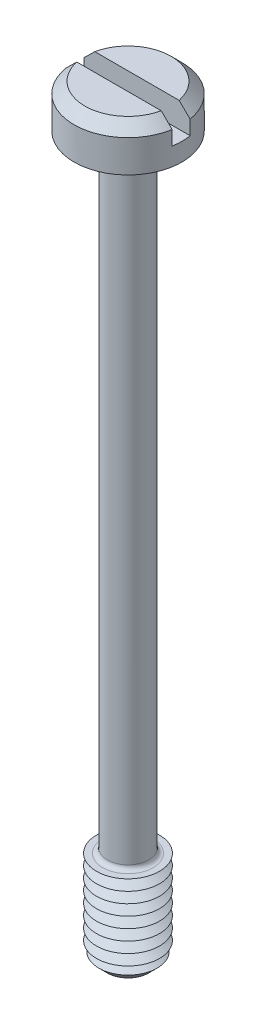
ISO-10303-21;
HEADER;
FILE_DESCRIPTION(('STEP AP214'),'2;1');
FILE_NAME('part.step','',(''),(''),'','','');
FILE_SCHEMA(('AUTOMOTIVE_DESIGN { 1 0 10303 214 1 1 1 1 }'));
ENDSEC;
DATA;
#1=APPLICATION_CONTEXT('core data for automotive mechanical design processes');
#2=APPLICATION_PROTOCOL_DEFINITION('international standard','automotive_design',2000,#1);
#3=PRODUCT_CONTEXT('',#1,'mechanical');
#4=PRODUCT('Part','Part','',(#3));
#5=PRODUCT_RELATED_PRODUCT_CATEGORY('part','',(#4));
#6=PRODUCT_DEFINITION_FORMATION('','',#4);
#7=PRODUCT_DEFINITION_CONTEXT('part definition',#1,'design');
#8=PRODUCT_DEFINITION('design','',#6,#7);
#9=PRODUCT_DEFINITION_SHAPE('','',#8);
#10=(LENGTH_UNIT() NAMED_UNIT(*) SI_UNIT(.MILLI.,.METRE.));
#11=(NAMED_UNIT(*) PLANE_ANGLE_UNIT() SI_UNIT($,.RADIAN.));
#12=(NAMED_UNIT(*) SI_UNIT($,.STERADIAN.) SOLID_ANGLE_UNIT());
#13=UNCERTAINTY_MEASURE_WITH_UNIT(LENGTH_MEASURE(1.E-05),#10,'distance_accuracy_value','');
#14=(GEOMETRIC_REPRESENTATION_CONTEXT(3) GLOBAL_UNCERTAINTY_ASSIGNED_CONTEXT((#13)) GLOBAL_UNIT_ASSIGNED_CONTEXT((#10,
#11,#12)) REPRESENTATION_CONTEXT('',''));
#15=CARTESIAN_POINT('',(0.,0.,0.));
#16=DIRECTION('',(0.,0.,1.));
#17=DIRECTION('',(1.,0.,0.));
#18=AXIS2_PLACEMENT_3D('',#15,#16,#17);
#19=CARTESIAN_POINT('',(0.,2.4,0.));
#20=DIRECTION('',(0.,1.,0.));
#21=DIRECTION('',(0.,0.,1.));
#22=AXIS2_PLACEMENT_3D('',#19,#20,#21);
#23=PLANE('',#22);
#24=DIRECTION('',(-1.,0.,0.));
#25=VECTOR('',#24,1.);
#26=CARTESIAN_POINT('',(3.,2.4,-0.5));
#27=LINE('',#26,#25);
#28=CARTESIAN_POINT('',(2.34733891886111,2.4,-0.5));
#29=VERTEX_POINT('',#28);
#30=CARTESIAN_POINT('',(-2.34733891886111,2.4,-0.5));
#31=VERTEX_POINT('',#30);
#32=EDGE_CURVE('E110',#29,#31,#27,.T.);
#33=ORIENTED_EDGE('',*,*,#32,.F.);
#34=CARTESIAN_POINT('',(0.,2.4,0.));
#35=DIRECTION('',(0.,1.,0.));
#36=DIRECTION('',(0.,0.,1.));
#37=AXIS2_PLACEMENT_3D('',#34,#35,#36);
#38=CIRCLE('',#37,2.40000000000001);
#39=EDGE_CURVE('E113',#29,#31,#38,.T.);
#40=ORIENTED_EDGE('',*,*,#39,.T.);
#41=EDGE_LOOP('',(#33,#40));
#42=FACE_BOUND('',#41,.T.);
#43=ADVANCED_FACE('F39',(#42),#23,.T.);
#44=CARTESIAN_POINT('',(0.,2.4,0.));
#45=DIRECTION('',(0.,-1.,0.));
#46=DIRECTION('',(0.,0.,-1.));
#47=AXIS2_PLACEMENT_3D('',#44,#45,#46);
#48=CONICAL_SURFACE('',#47,2.40000000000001,0.785398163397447);
#49=CARTESIAN_POINT('',(6.5992407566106,-1.81815522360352,-0.5));
#50=CARTESIAN_POINT('',(6.36552831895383,-1.58511655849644,-0.5));
#51=CARTESIAN_POINT('',(6.13178603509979,-1.35210779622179,-0.5));
#52=CARTESIAN_POINT('',(5.66419282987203,-0.886182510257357,-0.5));
#53=CARTESIAN_POINT('',(5.43034190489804,-0.653265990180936,-0.5));
#54=CARTESIAN_POINT('',(4.96229492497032,-0.187370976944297,-0.5));
#55=CARTESIAN_POINT('',(4.72809874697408,0.0456073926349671,-0.5));
#56=CARTESIAN_POINT('',(4.25949632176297,0.511336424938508,-0.5));
#57=CARTESIAN_POINT('',(4.0250900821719,0.744087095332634,-0.5));
#58=CARTESIAN_POINT('',(3.56605462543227,1.19918528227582,-0.5));
#59=CARTESIAN_POINT('',(3.34144041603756,1.42154792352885,-0.5));
#60=CARTESIAN_POINT('',(3.00406693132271,1.75465797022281,-0.5));
#61=CARTESIAN_POINT('',(2.89152775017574,1.8656282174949,-0.5));
#62=CARTESIAN_POINT('',(2.66624137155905,2.0873550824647,-0.5));
#63=CARTESIAN_POINT('',(2.55349417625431,2.19811170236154,-0.5));
#64=CARTESIAN_POINT('',(2.32775708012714,2.41925708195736,-0.5));
#65=CARTESIAN_POINT('',(2.21476734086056,2.52964600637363,-0.5));
#66=CARTESIAN_POINT('',(1.98831594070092,2.74994787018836,-0.5));
#67=CARTESIAN_POINT('',(1.87485426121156,2.85986079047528,-0.5));
#68=CARTESIAN_POINT('',(1.64719242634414,3.07888083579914,-0.5));
#69=CARTESIAN_POINT('',(1.53299241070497,3.18798810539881,-0.5));
#70=CARTESIAN_POINT('',(1.36063752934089,3.35052419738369,-0.5));
#71=CARTESIAN_POINT('',(1.30301197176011,3.40451369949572,-0.5));
#72=CARTESIAN_POINT('',(1.18725070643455,3.51194233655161,-0.5));
#73=CARTESIAN_POINT('',(1.12911501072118,3.56538148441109,-0.5));
#74=CARTESIAN_POINT('',(1.03810444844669,3.64783932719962,-0.5));
#75=CARTESIAN_POINT('',(1.00549358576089,3.67714917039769,-0.5));
#76=CARTESIAN_POINT('',(0.939964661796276,3.73543047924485,-0.5));
#77=CARTESIAN_POINT('',(0.90704657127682,3.76440191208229,-0.5));
#78=CARTESIAN_POINT('',(0.840581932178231,3.82209234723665,-0.5));
#79=CARTESIAN_POINT('',(0.807032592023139,3.85080814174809,-0.5));
#80=CARTESIAN_POINT('',(0.73940637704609,3.90759649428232,-0.5));
#81=CARTESIAN_POINT('',(0.7053296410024,3.93566921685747,-0.5));
#82=CARTESIAN_POINT('',(0.636165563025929,3.9911274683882,-0.5));
#83=CARTESIAN_POINT('',(0.6010722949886,4.01850564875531,-0.5));
#84=CARTESIAN_POINT('',(0.529844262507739,4.07186782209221,-0.5));
#85=CARTESIAN_POINT('',(0.493709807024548,4.09785222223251,-0.5));
#86=CARTESIAN_POINT('',(0.420142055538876,4.14747983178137,-0.5));
#87=CARTESIAN_POINT('',(0.382717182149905,4.17113535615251,-0.5));
#88=CARTESIAN_POINT('',(0.305809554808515,4.21475217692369,-0.5));
#89=CARTESIAN_POINT('',(0.266332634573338,4.234723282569,-0.5));
#90=CARTESIAN_POINT('',(0.194863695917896,4.26409059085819,-0.5));
#91=CARTESIAN_POINT('',(0.163467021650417,4.27488228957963,-0.5));
#92=CARTESIAN_POINT('',(0.0993951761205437,4.29114651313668,-0.5));
#93=CARTESIAN_POINT('',(0.06672672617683,4.29664386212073,-0.5));
#94=CARTESIAN_POINT('',(0.000596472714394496,4.30109247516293,-0.5));
#95=CARTESIAN_POINT('',(-0.0328699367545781,4.29998037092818,-0.5));
#96=CARTESIAN_POINT('',(-0.0990204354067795,4.2913596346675,-0.5));
#97=CARTESIAN_POINT('',(-0.131701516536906,4.28382951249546,-0.5));
#98=CARTESIAN_POINT('',(-0.187595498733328,4.2664576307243,-0.5));
#99=CARTESIAN_POINT('',(-0.211151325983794,4.25764794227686,-0.5));
#100=CARTESIAN_POINT('',(-0.25741941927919,4.23801581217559,-0.5));
#101=CARTESIAN_POINT('',(-0.280131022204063,4.22719182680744,-0.5));
#102=CARTESIAN_POINT('',(-0.324887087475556,4.20402808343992,-0.5));
#103=CARTESIAN_POINT('',(-0.346927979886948,4.19168154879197,-0.5));
#104=CARTESIAN_POINT('',(-0.390350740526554,4.16590953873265,-0.5));
#105=CARTESIAN_POINT('',(-0.411732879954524,4.15248451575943,-0.5));
#106=CARTESIAN_POINT('',(-0.483200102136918,4.1057271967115,-0.5));
#107=CARTESIAN_POINT('',(-0.532069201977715,4.07054939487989,-0.5));
#108=CARTESIAN_POINT('',(-0.62803419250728,3.99783710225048,-0.5));
#109=CARTESIAN_POINT('',(-0.675128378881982,3.96030043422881,-0.5));
#110=CARTESIAN_POINT('',(-0.768277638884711,3.88373232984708,-0.5));
#111=CARTESIAN_POINT('',(-0.814329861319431,3.84469743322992,-0.5));
#112=CARTESIAN_POINT('',(-0.90564084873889,3.76575507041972,-0.5));
#113=CARTESIAN_POINT('',(-0.950899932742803,3.72584797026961,-0.5));
#114=CARTESIAN_POINT('',(-1.04097019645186,3.64535266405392,-0.5));
#115=CARTESIAN_POINT('',(-1.08578029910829,3.60476325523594,-0.5));
#116=CARTESIAN_POINT('',(-1.17501433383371,3.52315414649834,-0.5));
#117=CARTESIAN_POINT('',(-1.2194382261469,3.48213440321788,-0.5));
#118=CARTESIAN_POINT('',(-1.35214179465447,3.35874463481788,-0.5));
#119=CARTESIAN_POINT('',(-1.43999477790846,3.27591618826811,-0.5));
#120=CARTESIAN_POINT('',(-1.61421087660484,3.11033648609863,-0.5));
#121=CARTESIAN_POINT('',(-1.70058023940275,3.02759177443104,-0.5));
#122=CARTESIAN_POINT('',(-1.87288923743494,2.86165572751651,-0.5));
#123=CARTESIAN_POINT('',(-1.9588288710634,2.77846439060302,-0.5));
#124=CARTESIAN_POINT('',(-2.21622491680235,2.52844403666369,-0.5));
#125=CARTESIAN_POINT('',(-2.38725269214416,2.36117421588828,-0.5));
#126=CARTESIAN_POINT('',(-2.7288261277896,2.02593191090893,-0.5));
#127=CARTESIAN_POINT('',(-2.8993714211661,1.85795905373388,-0.5));
#128=CARTESIAN_POINT('',(-3.24010524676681,1.52165721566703,-0.5));
#129=CARTESIAN_POINT('',(-3.41029378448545,1.35332824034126,-0.5));
#130=CARTESIAN_POINT('',(-3.75003309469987,1.01685288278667,-0.5));
#131=CARTESIAN_POINT('',(-3.91958441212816,0.848707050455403,-0.5));
#132=CARTESIAN_POINT('',(-4.25853538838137,0.512261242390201,-0.5));
#133=CARTESIAN_POINT('',(-4.4279350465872,0.343961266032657,-0.5));
#134=CARTESIAN_POINT('',(-4.93592097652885,-0.161044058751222,-0.5));
#135=CARTESIAN_POINT('',(-5.2743487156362,-0.497908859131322,-0.5));
#136=CARTESIAN_POINT('',(-5.69486651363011,-0.916769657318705,-0.5));
#137=CARTESIAN_POINT('',(-5.77706453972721,-0.998657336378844,-0.5));
#138=CARTESIAN_POINT('',(-5.94145013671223,-1.16244746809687,-0.5));
#139=CARTESIAN_POINT('',(-6.02363770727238,-1.24434992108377,-0.5));
#140=CARTESIAN_POINT('',(-6.18806790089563,-1.40823159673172,-0.5));
#141=CARTESIAN_POINT('',(-6.27031051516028,-1.49021082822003,-0.5));
#142=CARTESIAN_POINT('',(-6.43478378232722,-1.65417699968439,-0.5));
#143=CARTESIAN_POINT('',(-6.51701443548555,-1.73616393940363,-0.5));
#144=CARTESIAN_POINT('',(-6.5992407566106,-1.81815522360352,-0.5));
#145=B_SPLINE_CURVE_WITH_KNOTS('',3,(#49,#50,#51,#52,#53,#54,#55,#56,#57,#58,#59,#60,#61,#62,
#63,#64,#65,#66,#67,#68,#69,#70,#71,#72,#73,#74,#75,#76,#77,#78,#79,#80,#81,#82,#83,#84,#85,#86,
#87,#88,#89,#90,#91,#92,#93,#94,#95,#96,#97,#98,#99,#100,#101,#102,#103,#104,#105,#106,#107,
#108,#109,#110,#111,#112,#113,#114,#115,#116,#117,#118,#119,#120,#121,#122,#123,#124,#125,#126,
#127,#128,#129,#130,#131,#132,#133,#134,#135,#136,#137,#138,#139,#140,#141,#142,#143,#144),
.UNSPECIFIED.,.F.,.F.,(4,2,2,2,2,2,2,2,2,2,2,2,2,2,2,2,2,2,2,2,2,2,2,2,2,2,2,2,2,2,2,2,2,2,2,2,
2,2,2,2,2,2,2,2,2,2,2,4),(0.,0.99012966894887,1.98029489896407,2.97132503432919,
3.96232055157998,4.91051293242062,5.38465950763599,5.8588011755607,6.3326899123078,
6.80659750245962,7.28041788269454,7.51731276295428,7.75420207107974,7.88574051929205,
8.01729161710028,8.14976780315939,8.28220970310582,8.41571746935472,8.54918601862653,
8.68190589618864,8.81426715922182,8.91354607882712,9.01235719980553,9.11211719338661,
9.21221254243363,9.28755627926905,9.36295799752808,9.43870832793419,9.51442704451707,
9.69490147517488,9.87554500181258,10.0566343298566,10.2376490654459,10.4190258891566,
10.6004211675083,10.9626397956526,11.3214656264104,11.6802927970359,12.3979711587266,
13.1160968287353,13.8342113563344,14.5505812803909,15.2669541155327,16.6994694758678,
17.0475484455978,17.3956364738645,17.7440040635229,18.0923625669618),.UNSPECIFIED.);
#146=CARTESIAN_POINT('',(2.95803989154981,1.8,-0.5));
#147=VERTEX_POINT('',#146);
#148=EDGE_CURVE('E259',#147,#29,#145,.T.);
#149=ORIENTED_EDGE('',*,*,#148,.F.);
#150=CARTESIAN_POINT('',(0.,1.8,0.));
#151=DIRECTION('',(0.,1.,0.));
#152=DIRECTION('',(0.,0.,1.));
#153=AXIS2_PLACEMENT_3D('',#150,#151,#152);
#154=CIRCLE('',#153,3.);
#155=CARTESIAN_POINT('',(-2.95803989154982,1.8,-0.5));
#156=VERTEX_POINT('',#155);
#157=EDGE_CURVE('E127',#156,#147,#154,.F.);
#158=ORIENTED_EDGE('',*,*,#157,.F.);
#159=EDGE_CURVE('E102',#31,#156,#145,.T.);
#160=ORIENTED_EDGE('',*,*,#159,.F.);
#161=ORIENTED_EDGE('',*,*,#39,.F.);
#162=EDGE_LOOP('',(#149,#158,#160,#161));
#163=FACE_BOUND('',#162,.T.);
#164=ADVANCED_FACE('F221',(#163),#48,.T.);
#165=CARTESIAN_POINT('',(0.,-40.,0.));
#166=DIRECTION('',(0.,1.,0.));
#167=DIRECTION('',(0.,0.,1.));
#168=AXIS2_PLACEMENT_3D('',#165,#166,#167);
#169=CYLINDRICAL_SURFACE('',#168,1.15);
#170=CARTESIAN_POINT('',(0.,-34.55,0.));
#171=DIRECTION('',(0.,-1.,0.));
#172=DIRECTION('',(0.,0.,-1.));
#173=AXIS2_PLACEMENT_3D('',#170,#171,#172);
#174=CIRCLE('',#173,1.15);
#175=CARTESIAN_POINT('',(0.,-34.55,-1.15));
#176=VERTEX_POINT('',#175);
#177=EDGE_CURVE('E122',#176,#176,#174,.F.);
#178=ORIENTED_EDGE('',*,*,#177,.T.);
#179=EDGE_LOOP('',(#178));
#180=FACE_BOUND('',#179,.T.);
#181=CARTESIAN_POINT('',(0.,-0.25,0.));
#182=DIRECTION('',(0.,1.,0.));
#183=DIRECTION('',(0.,0.,1.));
#184=AXIS2_PLACEMENT_3D('',#181,#182,#183);
#185=CIRCLE('',#184,1.15);
#186=CARTESIAN_POINT('',(0.,-0.25,1.15));
#187=VERTEX_POINT('',#186);
#188=EDGE_CURVE('E366',#187,#187,#185,.F.);
#189=ORIENTED_EDGE('',*,*,#188,.T.);
#190=EDGE_LOOP('',(#189));
#191=FACE_BOUND('',#190,.T.);
#192=ADVANCED_FACE('F217',(#180,#191),#169,.T.);
#193=CARTESIAN_POINT('',(0.,2.4,0.));
#194=DIRECTION('',(0.,-1.,0.));
#195=DIRECTION('',(0.,0.,-1.));
#196=AXIS2_PLACEMENT_3D('',#193,#194,#195);
#197=CYLINDRICAL_SURFACE('',#196,3.);
#198=ORIENTED_EDGE('',*,*,#157,.T.);
#199=DIRECTION('',(0.,-1.,0.));
#200=VECTOR('',#199,1.);
#201=CARTESIAN_POINT('',(2.95803989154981,2.4,-0.5));
#202=LINE('',#201,#200);
#203=CARTESIAN_POINT('',(2.95803989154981,1.,-0.5));
#204=VERTEX_POINT('',#203);
#205=EDGE_CURVE('E64',#147,#204,#202,.T.);
#206=ORIENTED_EDGE('',*,*,#205,.T.);
#207=CARTESIAN_POINT('',(0.,1.,0.));
#208=DIRECTION('',(0.,1.,0.));
#209=DIRECTION('',(0.,0.,1.));
#210=AXIS2_PLACEMENT_3D('',#207,#208,#209);
#211=CIRCLE('',#210,3.);
#212=CARTESIAN_POINT('',(2.95803989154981,1.,0.5));
#213=VERTEX_POINT('',#212);
#214=EDGE_CURVE('E11',#213,#204,#211,.T.);
#215=ORIENTED_EDGE('',*,*,#214,.F.);
#216=DIRECTION('',(0.,-1.,0.));
#217=VECTOR('',#216,1.);
#218=CARTESIAN_POINT('',(2.95803989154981,2.4,0.5));
#219=LINE('',#218,#217);
#220=CARTESIAN_POINT('',(2.95803989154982,1.8,0.5));
#221=VERTEX_POINT('',#220);
#222=EDGE_CURVE('E276',#213,#221,#219,.F.);
#223=ORIENTED_EDGE('',*,*,#222,.T.);
#224=CARTESIAN_POINT('',(-2.95803989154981,1.8,0.5));
#225=VERTEX_POINT('',#224);
#226=EDGE_CURVE('E119',#221,#225,#154,.F.);
#227=ORIENTED_EDGE('',*,*,#226,.T.);
#228=DIRECTION('',(0.,-1.,0.));
#229=VECTOR('',#228,1.);
#230=CARTESIAN_POINT('',(-2.95803989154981,2.4,0.5));
#231=LINE('',#230,#229);
#232=CARTESIAN_POINT('',(-2.95803989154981,1.,0.5));
#233=VERTEX_POINT('',#232);
#234=EDGE_CURVE('E96',#225,#233,#231,.T.);
#235=ORIENTED_EDGE('',*,*,#234,.T.);
#236=CARTESIAN_POINT('',(-2.95803989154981,1.,-0.5));
#237=VERTEX_POINT('',#236);
#238=EDGE_CURVE('E44',#237,#233,#211,.T.);
#239=ORIENTED_EDGE('',*,*,#238,.F.);
#240=DIRECTION('',(0.,-1.,0.));
#241=VECTOR('',#240,1.);
#242=CARTESIAN_POINT('',(-2.95803989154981,2.4,-0.5));
#243=LINE('',#242,#241);
#244=EDGE_CURVE('E280',#237,#156,#243,.F.);
#245=ORIENTED_EDGE('',*,*,#244,.T.);
#246=EDGE_LOOP('',(#198,#206,#215,#223,#227,#235,#239,#245));
#247=FACE_BOUND('',#246,.T.);
#248=CARTESIAN_POINT('',(0.,0.,0.));
#249=DIRECTION('',(0.,1.,0.));
#250=DIRECTION('',(0.,0.,1.));
#251=AXIS2_PLACEMENT_3D('',#248,#249,#250);
#252=CIRCLE('',#251,3.);
#253=CARTESIAN_POINT('',(0.,0.,3.));
#254=VERTEX_POINT('',#253);
#255=EDGE_CURVE('E351',#254,#254,#252,.T.);
#256=ORIENTED_EDGE('',*,*,#255,.T.);
#257=EDGE_LOOP('',(#256));
#258=FACE_BOUND('',#257,.T.);
#259=ADVANCED_FACE('F220',(#247,#258),#197,.T.);
#260=DIRECTION('',(1.,0.,0.));
#261=VECTOR('',#260,1.);
#262=CARTESIAN_POINT('',(3.,2.4,0.5));
#263=LINE('',#262,#261);
#264=CARTESIAN_POINT('',(-2.34733891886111,2.4,0.5));
#265=VERTEX_POINT('',#264);
#266=CARTESIAN_POINT('',(2.34733891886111,2.4,0.5));
#267=VERTEX_POINT('',#266);
#268=EDGE_CURVE('E56',#265,#267,#263,.T.);
#269=ORIENTED_EDGE('',*,*,#268,.F.);
#270=EDGE_CURVE('E108',#265,#267,#38,.T.);
#271=ORIENTED_EDGE('',*,*,#270,.T.);
#272=EDGE_LOOP('',(#269,#271));
#273=FACE_BOUND('',#272,.T.);
#274=ADVANCED_FACE('F107',(#273),#23,.T.);
#275=CARTESIAN_POINT('',(0.,0.,0.));
#276=DIRECTION('',(0.,1.,0.));
#277=DIRECTION('',(0.,0.,1.));
#278=AXIS2_PLACEMENT_3D('',#275,#276,#277);
#279=PLANE('',#278);
#280=CARTESIAN_POINT('',(0.,0.,0.));
#281=DIRECTION('',(0.,1.,0.));
#282=DIRECTION('',(0.,0.,1.));
#283=AXIS2_PLACEMENT_3D('',#280,#281,#282);
#284=CIRCLE('',#283,1.4);
#285=CARTESIAN_POINT('',(0.,0.,1.4));
#286=VERTEX_POINT('',#285);
#287=EDGE_CURVE('E114',#286,#286,#284,.T.);
#288=ORIENTED_EDGE('',*,*,#287,.T.);
#289=EDGE_LOOP('',(#288));
#290=FACE_BOUND('',#289,.T.);
#291=ORIENTED_EDGE('',*,*,#255,.F.);
#292=EDGE_LOOP('',(#291));
#293=FACE_BOUND('',#292,.T.);
#294=ADVANCED_FACE('F211',(#290,#293),#279,.F.);
#295=CARTESIAN_POINT('',(0.,-34.8,0.));
#296=DIRECTION('',(0.,-1.,0.));
#297=DIRECTION('',(0.,0.,-1.));
#298=AXIS2_PLACEMENT_3D('',#295,#296,#297);
#299=PLANE('',#298);
#300=CARTESIAN_POINT('',(0.,-34.8,0.));
#301=DIRECTION('',(0.,-1.,0.));
#302=DIRECTION('',(0.,0.,-1.));
#303=AXIS2_PLACEMENT_3D('',#300,#301,#302);
#304=CIRCLE('',#303,1.4);
#305=CARTESIAN_POINT('',(0.,-34.8,-1.4));
#306=VERTEX_POINT('',#305);
#307=EDGE_CURVE('E359',#306,#306,#304,.T.);
#308=ORIENTED_EDGE('',*,*,#307,.T.);
#309=EDGE_LOOP('',(#308));
#310=FACE_BOUND('',#309,.T.);
#311=CARTESIAN_POINT('',(0.,-34.8,0.));
#312=DIRECTION('',(0.,1.,0.));
#313=DIRECTION('',(0.,0.,1.));
#314=AXIS2_PLACEMENT_3D('',#311,#312,#313);
#315=CIRCLE('',#314,1.75);
#316=CARTESIAN_POINT('',(0.,-34.8,1.75));
#317=VERTEX_POINT('',#316);
#318=EDGE_CURVE('E348',#317,#317,#315,.T.);
#319=ORIENTED_EDGE('',*,*,#318,.T.);
#320=EDGE_LOOP('',(#319));
#321=FACE_BOUND('',#320,.T.);
#322=ADVANCED_FACE('F207',(#310,#321),#299,.F.);
#323=CARTESIAN_POINT('',(0.,-35.1,0.));
#324=DIRECTION('',(0.,1.,0.));
#325=DIRECTION('',(0.,0.,1.));
#326=AXIS2_PLACEMENT_3D('',#323,#324,#325);
#327=CONICAL_SURFACE('',#326,1.23038475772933,1.04719755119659);
#328=ORIENTED_EDGE('',*,*,#318,.F.);
#329=EDGE_LOOP('',(#328));
#330=FACE_BOUND('',#329,.T.);
#331=CARTESIAN_POINT('',(0.,-35.1,0.));
#332=DIRECTION('',(0.,1.,0.));
#333=DIRECTION('',(0.,0.,1.));
#334=AXIS2_PLACEMENT_3D('',#331,#332,#333);
#335=CIRCLE('',#334,1.23038475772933);
#336=CARTESIAN_POINT('',(0.,-35.1,1.23038475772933));
#337=VERTEX_POINT('',#336);
#338=EDGE_CURVE('E344',#337,#337,#335,.T.);
#339=ORIENTED_EDGE('',*,*,#338,.T.);
#340=EDGE_LOOP('',(#339));
#341=FACE_BOUND('',#340,.T.);
#342=ADVANCED_FACE('F203',(#330,#341),#327,.T.);
#343=CARTESIAN_POINT('',(0.,-35.4,0.));
#344=DIRECTION('',(0.,-1.,0.));
#345=DIRECTION('',(0.,0.,-1.));
#346=AXIS2_PLACEMENT_3D('',#343,#344,#345);
#347=CONICAL_SURFACE('',#346,1.75,1.04719755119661);
#348=ORIENTED_EDGE('',*,*,#338,.F.);
#349=EDGE_LOOP('',(#348));
#350=FACE_BOUND('',#349,.T.);
#351=CARTESIAN_POINT('',(0.,-35.4,0.));
#352=DIRECTION('',(0.,1.,0.));
#353=DIRECTION('',(0.,0.,1.));
#354=AXIS2_PLACEMENT_3D('',#351,#352,#353);
#355=CIRCLE('',#354,1.75);
#356=CARTESIAN_POINT('',(0.,-35.4,1.75));
#357=VERTEX_POINT('',#356);
#358=EDGE_CURVE('E340',#357,#357,#355,.T.);
#359=ORIENTED_EDGE('',*,*,#358,.T.);
#360=EDGE_LOOP('',(#359));
#361=FACE_BOUND('',#360,.T.);
#362=ADVANCED_FACE('F199',(#350,#361),#347,.T.);
#363=CARTESIAN_POINT('',(0.,-35.7,0.));
#364=DIRECTION('',(0.,1.,0.));
#365=DIRECTION('',(0.,0.,1.));
#366=AXIS2_PLACEMENT_3D('',#363,#364,#365);
#367=CONICAL_SURFACE('',#366,1.23038475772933,1.04719755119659);
#368=ORIENTED_EDGE('',*,*,#358,.F.);
#369=EDGE_LOOP('',(#368));
#370=FACE_BOUND('',#369,.T.);
#371=CARTESIAN_POINT('',(0.,-35.7,0.));
#372=DIRECTION('',(0.,1.,0.));
#373=DIRECTION('',(0.,0.,1.));
#374=AXIS2_PLACEMENT_3D('',#371,#372,#373);
#375=CIRCLE('',#374,1.23038475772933);
#376=CARTESIAN_POINT('',(0.,-35.7,1.23038475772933));
#377=VERTEX_POINT('',#376);
#378=EDGE_CURVE('E336',#377,#377,#375,.T.);
#379=ORIENTED_EDGE('',*,*,#378,.T.);
#380=EDGE_LOOP('',(#379));
#381=FACE_BOUND('',#380,.T.);
#382=ADVANCED_FACE('F195',(#370,#381),#367,.T.);
#383=CARTESIAN_POINT('',(0.,-36.,0.));
#384=DIRECTION('',(0.,-1.,0.));
#385=DIRECTION('',(0.,0.,-1.));
#386=AXIS2_PLACEMENT_3D('',#383,#384,#385);
#387=CONICAL_SURFACE('',#386,1.75,1.04719755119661);
#388=ORIENTED_EDGE('',*,*,#378,.F.);
#389=EDGE_LOOP('',(#388));
#390=FACE_BOUND('',#389,.T.);
#391=CARTESIAN_POINT('',(0.,-36.,0.));
#392=DIRECTION('',(0.,1.,0.));
#393=DIRECTION('',(0.,0.,1.));
#394=AXIS2_PLACEMENT_3D('',#391,#392,#393);
#395=CIRCLE('',#394,1.75);
#396=CARTESIAN_POINT('',(0.,-36.,1.75));
#397=VERTEX_POINT('',#396);
#398=EDGE_CURVE('E332',#397,#397,#395,.T.);
#399=ORIENTED_EDGE('',*,*,#398,.T.);
#400=EDGE_LOOP('',(#399));
#401=FACE_BOUND('',#400,.T.);
#402=ADVANCED_FACE('F191',(#390,#401),#387,.T.);
#403=CARTESIAN_POINT('',(0.,-36.3,0.));
#404=DIRECTION('',(0.,1.,0.));
#405=DIRECTION('',(0.,0.,1.));
#406=AXIS2_PLACEMENT_3D('',#403,#404,#405);
#407=CONICAL_SURFACE('',#406,1.23038475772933,1.04719755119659);
#408=ORIENTED_EDGE('',*,*,#398,.F.);
#409=EDGE_LOOP('',(#408));
#410=FACE_BOUND('',#409,.T.);
#411=CARTESIAN_POINT('',(0.,-36.3,0.));
#412=DIRECTION('',(0.,1.,0.));
#413=DIRECTION('',(0.,0.,1.));
#414=AXIS2_PLACEMENT_3D('',#411,#412,#413);
#415=CIRCLE('',#414,1.23038475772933);
#416=CARTESIAN_POINT('',(0.,-36.3,1.23038475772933));
#417=VERTEX_POINT('',#416);
#418=EDGE_CURVE('E329',#417,#417,#415,.T.);
#419=ORIENTED_EDGE('',*,*,#418,.T.);
#420=EDGE_LOOP('',(#419));
#421=FACE_BOUND('',#420,.T.);
#422=ADVANCED_FACE('F187',(#410,#421),#407,.T.);
#423=CARTESIAN_POINT('',(0.,-36.6,0.));
#424=DIRECTION('',(0.,-1.,0.));
#425=DIRECTION('',(0.,0.,-1.));
#426=AXIS2_PLACEMENT_3D('',#423,#424,#425);
#427=CONICAL_SURFACE('',#426,1.75,1.04719755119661);
#428=ORIENTED_EDGE('',*,*,#418,.F.);
#429=EDGE_LOOP('',(#428));
#430=FACE_BOUND('',#429,.T.);
#431=CARTESIAN_POINT('',(0.,-36.6,0.));
#432=DIRECTION('',(0.,1.,0.));
#433=DIRECTION('',(0.,0.,1.));
#434=AXIS2_PLACEMENT_3D('',#431,#432,#433);
#435=CIRCLE('',#434,1.75);
#436=CARTESIAN_POINT('',(0.,-36.6,1.75));
#437=VERTEX_POINT('',#436);
#438=EDGE_CURVE('E326',#437,#437,#435,.T.);
#439=ORIENTED_EDGE('',*,*,#438,.T.);
#440=EDGE_LOOP('',(#439));
#441=FACE_BOUND('',#440,.T.);
#442=ADVANCED_FACE('F183',(#430,#441),#427,.T.);
#443=CARTESIAN_POINT('',(0.,-36.9,0.));
#444=DIRECTION('',(0.,1.,0.));
#445=DIRECTION('',(0.,0.,1.));
#446=AXIS2_PLACEMENT_3D('',#443,#444,#445);
#447=CONICAL_SURFACE('',#446,1.23038475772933,1.04719755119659);
#448=ORIENTED_EDGE('',*,*,#438,.F.);
#449=EDGE_LOOP('',(#448));
#450=FACE_BOUND('',#449,.T.);
#451=CARTESIAN_POINT('',(0.,-36.9,0.));
#452=DIRECTION('',(0.,1.,0.));
#453=DIRECTION('',(0.,0.,1.));
#454=AXIS2_PLACEMENT_3D('',#451,#452,#453);
#455=CIRCLE('',#454,1.23038475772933);
#456=CARTESIAN_POINT('',(0.,-36.9,1.23038475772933));
#457=VERTEX_POINT('',#456);
#458=EDGE_CURVE('E322',#457,#457,#455,.T.);
#459=ORIENTED_EDGE('',*,*,#458,.T.);
#460=EDGE_LOOP('',(#459));
#461=FACE_BOUND('',#460,.T.);
#462=ADVANCED_FACE('F179',(#450,#461),#447,.T.);
#463=CARTESIAN_POINT('',(0.,-37.2,0.));
#464=DIRECTION('',(0.,-1.,0.));
#465=DIRECTION('',(0.,0.,-1.));
#466=AXIS2_PLACEMENT_3D('',#463,#464,#465);
#467=CONICAL_SURFACE('',#466,1.75,1.04719755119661);
#468=ORIENTED_EDGE('',*,*,#458,.F.);
#469=EDGE_LOOP('',(#468));
#470=FACE_BOUND('',#469,.T.);
#471=CARTESIAN_POINT('',(0.,-37.2,0.));
#472=DIRECTION('',(0.,1.,0.));
#473=DIRECTION('',(0.,0.,1.));
#474=AXIS2_PLACEMENT_3D('',#471,#472,#473);
#475=CIRCLE('',#474,1.75);
#476=CARTESIAN_POINT('',(0.,-37.2,1.75));
#477=VERTEX_POINT('',#476);
#478=EDGE_CURVE('E319',#477,#477,#475,.T.);
#479=ORIENTED_EDGE('',*,*,#478,.T.);
#480=EDGE_LOOP('',(#479));
#481=FACE_BOUND('',#480,.T.);
#482=ADVANCED_FACE('F175',(#470,#481),#467,.T.);
#483=CARTESIAN_POINT('',(0.,-37.5,0.));
#484=DIRECTION('',(0.,1.,0.));
#485=DIRECTION('',(0.,0.,1.));
#486=AXIS2_PLACEMENT_3D('',#483,#484,#485);
#487=CONICAL_SURFACE('',#486,1.23038475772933,1.04719755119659);
#488=ORIENTED_EDGE('',*,*,#478,.F.);
#489=EDGE_LOOP('',(#488));
#490=FACE_BOUND('',#489,.T.);
#491=CARTESIAN_POINT('',(0.,-37.5,0.));
#492=DIRECTION('',(0.,1.,0.));
#493=DIRECTION('',(0.,0.,1.));
#494=AXIS2_PLACEMENT_3D('',#491,#492,#493);
#495=CIRCLE('',#494,1.23038475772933);
#496=CARTESIAN_POINT('',(0.,-37.5,1.23038475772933));
#497=VERTEX_POINT('',#496);
#498=EDGE_CURVE('E315',#497,#497,#495,.T.);
#499=ORIENTED_EDGE('',*,*,#498,.T.);
#500=EDGE_LOOP('',(#499));
#501=FACE_BOUND('',#500,.T.);
#502=ADVANCED_FACE('F171',(#490,#501),#487,.T.);
#503=CARTESIAN_POINT('',(0.,-37.8,0.));
#504=DIRECTION('',(0.,-1.,0.));
#505=DIRECTION('',(0.,0.,-1.));
#506=AXIS2_PLACEMENT_3D('',#503,#504,#505);
#507=CONICAL_SURFACE('',#506,1.75,1.04719755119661);
#508=ORIENTED_EDGE('',*,*,#498,.F.);
#509=EDGE_LOOP('',(#508));
#510=FACE_BOUND('',#509,.T.);
#511=CARTESIAN_POINT('',(0.,-37.8,0.));
#512=DIRECTION('',(0.,1.,0.));
#513=DIRECTION('',(0.,0.,1.));
#514=AXIS2_PLACEMENT_3D('',#511,#512,#513);
#515=CIRCLE('',#514,1.75);
#516=CARTESIAN_POINT('',(0.,-37.8,1.75));
#517=VERTEX_POINT('',#516);
#518=EDGE_CURVE('E311',#517,#517,#515,.T.);
#519=ORIENTED_EDGE('',*,*,#518,.T.);
#520=EDGE_LOOP('',(#519));
#521=FACE_BOUND('',#520,.T.);
#522=ADVANCED_FACE('F167',(#510,#521),#507,.T.);
#523=CARTESIAN_POINT('',(0.,-38.1,0.));
#524=DIRECTION('',(0.,1.,0.));
#525=DIRECTION('',(0.,0.,1.));
#526=AXIS2_PLACEMENT_3D('',#523,#524,#525);
#527=CONICAL_SURFACE('',#526,1.23038475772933,1.04719755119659);
#528=ORIENTED_EDGE('',*,*,#518,.F.);
#529=EDGE_LOOP('',(#528));
#530=FACE_BOUND('',#529,.T.);
#531=CARTESIAN_POINT('',(0.,-38.1,0.));
#532=DIRECTION('',(0.,1.,0.));
#533=DIRECTION('',(0.,0.,1.));
#534=AXIS2_PLACEMENT_3D('',#531,#532,#533);
#535=CIRCLE('',#534,1.23038475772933);
#536=CARTESIAN_POINT('',(0.,-38.1,1.23038475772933));
#537=VERTEX_POINT('',#536);
#538=EDGE_CURVE('E307',#537,#537,#535,.T.);
#539=ORIENTED_EDGE('',*,*,#538,.T.);
#540=EDGE_LOOP('',(#539));
#541=FACE_BOUND('',#540,.T.);
#542=ADVANCED_FACE('F163',(#530,#541),#527,.T.);
#543=CARTESIAN_POINT('',(0.,-38.4,0.));
#544=DIRECTION('',(0.,-1.,0.));
#545=DIRECTION('',(0.,0.,-1.));
#546=AXIS2_PLACEMENT_3D('',#543,#544,#545);
#547=CONICAL_SURFACE('',#546,1.75,1.04719755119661);
#548=ORIENTED_EDGE('',*,*,#538,.F.);
#549=EDGE_LOOP('',(#548));
#550=FACE_BOUND('',#549,.T.);
#551=CARTESIAN_POINT('',(0.,-38.4,0.));
#552=DIRECTION('',(0.,1.,0.));
#553=DIRECTION('',(0.,0.,1.));
#554=AXIS2_PLACEMENT_3D('',#551,#552,#553);
#555=CIRCLE('',#554,1.75);
#556=CARTESIAN_POINT('',(0.,-38.4,1.75));
#557=VERTEX_POINT('',#556);
#558=EDGE_CURVE('E303',#557,#557,#555,.T.);
#559=ORIENTED_EDGE('',*,*,#558,.T.);
#560=EDGE_LOOP('',(#559));
#561=FACE_BOUND('',#560,.T.);
#562=ADVANCED_FACE('F159',(#550,#561),#547,.T.);
#563=CARTESIAN_POINT('',(0.,-38.7,0.));
#564=DIRECTION('',(0.,1.,0.));
#565=DIRECTION('',(0.,0.,1.));
#566=AXIS2_PLACEMENT_3D('',#563,#564,#565);
#567=CONICAL_SURFACE('',#566,1.23038475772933,1.04719755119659);
#568=ORIENTED_EDGE('',*,*,#558,.F.);
#569=EDGE_LOOP('',(#568));
#570=FACE_BOUND('',#569,.T.);
#571=CARTESIAN_POINT('',(0.,-38.7,0.));
#572=DIRECTION('',(0.,1.,0.));
#573=DIRECTION('',(0.,0.,1.));
#574=AXIS2_PLACEMENT_3D('',#571,#572,#573);
#575=CIRCLE('',#574,1.23038475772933);
#576=CARTESIAN_POINT('',(0.,-38.7,1.23038475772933));
#577=VERTEX_POINT('',#576);
#578=EDGE_CURVE('E299',#577,#577,#575,.T.);
#579=ORIENTED_EDGE('',*,*,#578,.T.);
#580=EDGE_LOOP('',(#579));
#581=FACE_BOUND('',#580,.T.);
#582=ADVANCED_FACE('F155',(#570,#581),#567,.T.);
#583=CARTESIAN_POINT('',(0.,-39.,0.));
#584=DIRECTION('',(0.,-1.,0.));
#585=DIRECTION('',(0.,0.,-1.));
#586=AXIS2_PLACEMENT_3D('',#583,#584,#585);
#587=CONICAL_SURFACE('',#586,1.75,1.04719755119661);
#588=ORIENTED_EDGE('',*,*,#578,.F.);
#589=EDGE_LOOP('',(#588));
#590=FACE_BOUND('',#589,.T.);
#591=CARTESIAN_POINT('',(0.,-39.,0.));
#592=DIRECTION('',(0.,1.,0.));
#593=DIRECTION('',(0.,0.,1.));
#594=AXIS2_PLACEMENT_3D('',#591,#592,#593);
#595=CIRCLE('',#594,1.75);
#596=CARTESIAN_POINT('',(0.,-39.,1.75));
#597=VERTEX_POINT('',#596);
#598=EDGE_CURVE('E294',#597,#597,#595,.T.);
#599=ORIENTED_EDGE('',*,*,#598,.T.);
#600=EDGE_LOOP('',(#599));
#601=FACE_BOUND('',#600,.T.);
#602=ADVANCED_FACE('F151',(#590,#601),#587,.T.);
#603=CARTESIAN_POINT('',(0.,-39.3,0.));
#604=DIRECTION('',(0.,1.,0.));
#605=DIRECTION('',(0.,0.,1.));
#606=AXIS2_PLACEMENT_3D('',#603,#604,#605);
#607=CONICAL_SURFACE('',#606,1.23038475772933,1.04719755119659);
#608=ORIENTED_EDGE('',*,*,#598,.F.);
#609=EDGE_LOOP('',(#608));
#610=FACE_BOUND('',#609,.T.);
#611=CARTESIAN_POINT('',(0.,-39.3,0.));
#612=DIRECTION('',(0.,1.,0.));
#613=DIRECTION('',(0.,0.,1.));
#614=AXIS2_PLACEMENT_3D('',#611,#612,#613);
#615=CIRCLE('',#614,1.23038475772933);
#616=CARTESIAN_POINT('',(0.,-39.3,1.23038475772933));
#617=VERTEX_POINT('',#616);
#618=EDGE_CURVE('E290',#617,#617,#615,.T.);
#619=ORIENTED_EDGE('',*,*,#618,.T.);
#620=EDGE_LOOP('',(#619));
#621=FACE_BOUND('',#620,.T.);
#622=ADVANCED_FACE('F147',(#610,#621),#607,.T.);
#623=CARTESIAN_POINT('',(0.,-39.6,0.));
#624=DIRECTION('',(0.,-1.,0.));
#625=DIRECTION('',(0.,0.,-1.));
#626=AXIS2_PLACEMENT_3D('',#623,#624,#625);
#627=CONICAL_SURFACE('',#626,1.75,1.04719755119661);
#628=CARTESIAN_POINT('',(0.,-39.5267949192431,0.));
#629=DIRECTION('',(0.,-1.,0.));
#630=DIRECTION('',(0.,0.,-1.));
#631=AXIS2_PLACEMENT_3D('',#628,#629,#630);
#632=CIRCLE('',#631,1.62320508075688);
#633=CARTESIAN_POINT('',(0.,-39.5267949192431,-1.62320508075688));
#634=VERTEX_POINT('',#633);
#635=EDGE_CURVE('E298',#634,#634,#632,.F.);
#636=ORIENTED_EDGE('',*,*,#635,.T.);
#637=EDGE_LOOP('',(#636));
#638=FACE_BOUND('',#637,.T.);
#639=ORIENTED_EDGE('',*,*,#618,.F.);
#640=EDGE_LOOP('',(#639));
#641=FACE_BOUND('',#640,.T.);
#642=ADVANCED_FACE('F143',(#638,#641),#627,.T.);
#643=CARTESIAN_POINT('',(0.,-40.,0.));
#644=DIRECTION('',(0.,-1.,0.));
#645=DIRECTION('',(0.,0.,-1.));
#646=AXIS2_PLACEMENT_3D('',#643,#644,#645);
#647=PLANE('',#646);
#648=CARTESIAN_POINT('',(0.,-40.,0.));
#649=DIRECTION('',(0.,-1.,0.));
#650=DIRECTION('',(0.,0.,-1.));
#651=AXIS2_PLACEMENT_3D('',#648,#649,#650);
#652=CIRCLE('',#651,1.14999999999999);
#653=CARTESIAN_POINT('',(0.,-40.,-1.14999999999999));
#654=VERTEX_POINT('',#653);
#655=EDGE_CURVE('E355',#654,#654,#652,.T.);
#656=ORIENTED_EDGE('',*,*,#655,.T.);
#657=EDGE_LOOP('',(#656));
#658=FACE_BOUND('',#657,.T.);
#659=ADVANCED_FACE('F146',(#658),#647,.T.);
#660=CARTESIAN_POINT('',(0.,-40.,0.));
#661=DIRECTION('',(0.,1.,0.));
#662=DIRECTION('',(0.,0.,1.));
#663=AXIS2_PLACEMENT_3D('',#660,#661,#662);
#664=CONICAL_SURFACE('',#663,1.14999999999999,0.78539816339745);
#665=ORIENTED_EDGE('',*,*,#635,.F.);
#666=EDGE_LOOP('',(#665));
#667=FACE_BOUND('',#666,.T.);
#668=ORIENTED_EDGE('',*,*,#655,.F.);
#669=EDGE_LOOP('',(#668));
#670=FACE_BOUND('',#669,.T.);
#671=ADVANCED_FACE('F215',(#667,#670),#664,.T.);
#672=CARTESIAN_POINT('',(0.,-34.55,0.));
#673=DIRECTION('',(0.,-1.,0.));
#674=DIRECTION('',(0.,0.,-1.));
#675=AXIS2_PLACEMENT_3D('',#672,#673,#674);
#676=TOROIDAL_SURFACE('',#675,1.4,0.25);
#677=ORIENTED_EDGE('',*,*,#177,.F.);
#678=EDGE_LOOP('',(#677));
#679=FACE_BOUND('',#678,.T.);
#680=ORIENTED_EDGE('',*,*,#307,.F.);
#681=EDGE_LOOP('',(#680));
#682=FACE_BOUND('',#681,.T.);
#683=ADVANCED_FACE('F233',(#679,#682),#676,.F.);
#684=CARTESIAN_POINT('',(0.,-0.25,0.));
#685=DIRECTION('',(0.,1.,0.));
#686=DIRECTION('',(0.,0.,1.));
#687=AXIS2_PLACEMENT_3D('',#684,#685,#686);
#688=TOROIDAL_SURFACE('',#687,1.4,0.25);
#689=ORIENTED_EDGE('',*,*,#287,.F.);
#690=EDGE_LOOP('',(#689));
#691=FACE_BOUND('',#690,.T.);
#692=ORIENTED_EDGE('',*,*,#188,.F.);
#693=EDGE_LOOP('',(#692));
#694=FACE_BOUND('',#693,.T.);
#695=ADVANCED_FACE('F236',(#691,#694),#688,.F.);
#696=CARTESIAN_POINT('',(-6.5992407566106,-1.81815522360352,0.5));
#697=CARTESIAN_POINT('',(-6.36552831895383,-1.58511655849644,0.5));
#698=CARTESIAN_POINT('',(-6.13178603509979,-1.35210779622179,0.5));
#699=CARTESIAN_POINT('',(-5.66419282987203,-0.886182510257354,0.5));
#700=CARTESIAN_POINT('',(-5.43034190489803,-0.653265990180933,0.5));
#701=CARTESIAN_POINT('',(-4.96229492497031,-0.187370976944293,0.5));
#702=CARTESIAN_POINT('',(-4.72809874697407,0.0456073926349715,0.5));
#703=CARTESIAN_POINT('',(-4.25949632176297,0.511336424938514,0.5));
#704=CARTESIAN_POINT('',(-4.02509008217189,0.744087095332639,0.5));
#705=CARTESIAN_POINT('',(-3.56605462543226,1.19918528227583,0.5));
#706=CARTESIAN_POINT('',(-3.34144041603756,1.42154792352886,0.5));
#707=CARTESIAN_POINT('',(-3.0040669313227,1.75465797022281,0.5));
#708=CARTESIAN_POINT('',(-2.89152775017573,1.8656282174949,0.5));
#709=CARTESIAN_POINT('',(-2.66624137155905,2.0873550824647,0.5));
#710=CARTESIAN_POINT('',(-2.55349417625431,2.19811170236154,0.5));
#711=CARTESIAN_POINT('',(-2.32775708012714,2.41925708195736,0.5));
#712=CARTESIAN_POINT('',(-2.21476734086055,2.52964600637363,0.5));
#713=CARTESIAN_POINT('',(-1.98831594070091,2.74994787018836,0.5));
#714=CARTESIAN_POINT('',(-1.87485426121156,2.85986079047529,0.5));
#715=CARTESIAN_POINT('',(-1.64719242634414,3.07888083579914,0.5));
#716=CARTESIAN_POINT('',(-1.53299241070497,3.18798810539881,0.5));
#717=CARTESIAN_POINT('',(-1.36063752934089,3.35052419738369,0.5));
#718=CARTESIAN_POINT('',(-1.3030119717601,3.40451369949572,0.5));
#719=CARTESIAN_POINT('',(-1.18725070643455,3.51194233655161,0.5));
#720=CARTESIAN_POINT('',(-1.12911501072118,3.56538148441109,0.5));
#721=CARTESIAN_POINT('',(-1.03810444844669,3.64783932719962,0.5));
#722=CARTESIAN_POINT('',(-1.00549358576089,3.67714917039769,0.5));
#723=CARTESIAN_POINT('',(-0.939964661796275,3.73543047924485,0.5));
#724=CARTESIAN_POINT('',(-0.907046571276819,3.76440191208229,0.5));
#725=CARTESIAN_POINT('',(-0.840581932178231,3.82209234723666,0.5));
#726=CARTESIAN_POINT('',(-0.807032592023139,3.85080814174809,0.5));
#727=CARTESIAN_POINT('',(-0.739406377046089,3.90759649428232,0.5));
#728=CARTESIAN_POINT('',(-0.705329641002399,3.93566921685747,0.5));
#729=CARTESIAN_POINT('',(-0.636165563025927,3.9911274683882,0.5));
#730=CARTESIAN_POINT('',(-0.601072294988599,4.01850564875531,0.5));
#731=CARTESIAN_POINT('',(-0.529844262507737,4.07186782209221,0.5));
#732=CARTESIAN_POINT('',(-0.493709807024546,4.09785222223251,0.5));
#733=CARTESIAN_POINT('',(-0.420142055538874,4.14747983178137,0.5));
#734=CARTESIAN_POINT('',(-0.382717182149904,4.17113535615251,0.5));
#735=CARTESIAN_POINT('',(-0.305809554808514,4.21475217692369,0.5));
#736=CARTESIAN_POINT('',(-0.266332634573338,4.234723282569,0.5));
#737=CARTESIAN_POINT('',(-0.194863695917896,4.26409059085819,0.5));
#738=CARTESIAN_POINT('',(-0.163467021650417,4.27488228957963,0.5));
#739=CARTESIAN_POINT('',(-0.0993951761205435,4.29114651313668,0.5));
#740=CARTESIAN_POINT('',(-0.0667267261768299,4.29664386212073,0.5));
#741=CARTESIAN_POINT('',(-0.000596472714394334,4.30109247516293,0.5));
#742=CARTESIAN_POINT('',(0.0328699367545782,4.29998037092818,0.5));
#743=CARTESIAN_POINT('',(0.0990204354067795,4.2913596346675,0.5));
#744=CARTESIAN_POINT('',(0.131701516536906,4.28382951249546,0.5));
#745=CARTESIAN_POINT('',(0.187595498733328,4.2664576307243,0.5));
#746=CARTESIAN_POINT('',(0.211151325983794,4.25764794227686,0.5));
#747=CARTESIAN_POINT('',(0.25741941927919,4.23801581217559,0.5));
#748=CARTESIAN_POINT('',(0.280131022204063,4.22719182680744,0.5));
#749=CARTESIAN_POINT('',(0.324887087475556,4.20402808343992,0.5));
#750=CARTESIAN_POINT('',(0.346927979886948,4.19168154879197,0.5));
#751=CARTESIAN_POINT('',(0.390350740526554,4.16590953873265,0.5));
#752=CARTESIAN_POINT('',(0.411732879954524,4.15248451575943,0.5));
#753=CARTESIAN_POINT('',(0.483200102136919,4.10572719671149,0.5));
#754=CARTESIAN_POINT('',(0.532069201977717,4.07054939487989,0.5));
#755=CARTESIAN_POINT('',(0.628034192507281,3.99783710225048,0.5));
#756=CARTESIAN_POINT('',(0.675128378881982,3.96030043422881,0.5));
#757=CARTESIAN_POINT('',(0.768277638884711,3.88373232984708,0.5));
#758=CARTESIAN_POINT('',(0.814329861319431,3.84469743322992,0.5));
#759=CARTESIAN_POINT('',(0.90564084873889,3.76575507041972,0.5));
#760=CARTESIAN_POINT('',(0.950899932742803,3.72584797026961,0.5));
#761=CARTESIAN_POINT('',(1.04097019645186,3.64535266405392,0.5));
#762=CARTESIAN_POINT('',(1.08578029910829,3.60476325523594,0.5));
#763=CARTESIAN_POINT('',(1.17501433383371,3.52315414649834,0.5));
#764=CARTESIAN_POINT('',(1.2194382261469,3.48213440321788,0.5));
#765=CARTESIAN_POINT('',(1.35214179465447,3.35874463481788,0.5));
#766=CARTESIAN_POINT('',(1.43999477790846,3.27591618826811,0.5));
#767=CARTESIAN_POINT('',(1.61421087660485,3.11033648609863,0.5));
#768=CARTESIAN_POINT('',(1.70058023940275,3.02759177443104,0.5));
#769=CARTESIAN_POINT('',(1.87288923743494,2.86165572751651,0.5));
#770=CARTESIAN_POINT('',(1.95882887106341,2.77846439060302,0.5));
#771=CARTESIAN_POINT('',(2.21622491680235,2.52844403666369,0.5));
#772=CARTESIAN_POINT('',(2.38725269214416,2.36117421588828,0.5));
#773=CARTESIAN_POINT('',(2.7288261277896,2.02593191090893,0.5));
#774=CARTESIAN_POINT('',(2.8993714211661,1.85795905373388,0.5));
#775=CARTESIAN_POINT('',(3.24010524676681,1.52165721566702,0.5));
#776=CARTESIAN_POINT('',(3.41029378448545,1.35332824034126,0.5));
#777=CARTESIAN_POINT('',(3.75003309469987,1.01685288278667,0.5));
#778=CARTESIAN_POINT('',(3.91958441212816,0.848707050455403,0.5));
#779=CARTESIAN_POINT('',(4.25853538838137,0.5122612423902,0.5));
#780=CARTESIAN_POINT('',(4.42793504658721,0.343961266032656,0.5));
#781=CARTESIAN_POINT('',(4.93592097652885,-0.161044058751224,0.5));
#782=CARTESIAN_POINT('',(5.2743487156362,-0.497908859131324,0.5));
#783=CARTESIAN_POINT('',(5.69486651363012,-0.916769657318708,0.5));
#784=CARTESIAN_POINT('',(5.77706453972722,-0.998657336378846,0.5));
#785=CARTESIAN_POINT('',(5.94145013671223,-1.16244746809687,0.5));
#786=CARTESIAN_POINT('',(6.02363770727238,-1.24434992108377,0.5));
#787=CARTESIAN_POINT('',(6.18806790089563,-1.40823159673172,0.5));
#788=CARTESIAN_POINT('',(6.27031051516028,-1.49021082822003,0.5));
#789=CARTESIAN_POINT('',(6.43478378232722,-1.65417699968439,0.5));
#790=CARTESIAN_POINT('',(6.51701443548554,-1.73616393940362,0.5));
#791=CARTESIAN_POINT('',(6.5992407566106,-1.81815522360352,0.5));
#792=B_SPLINE_CURVE_WITH_KNOTS('',3,(#696,#697,#698,#699,#700,#701,#702,#703,#704,#705,#706,
#707,#708,#709,#710,#711,#712,#713,#714,#715,#716,#717,#718,#719,#720,#721,#722,#723,#724,#725,
#726,#727,#728,#729,#730,#731,#732,#733,#734,#735,#736,#737,#738,#739,#740,#741,#742,#743,#744,
#745,#746,#747,#748,#749,#750,#751,#752,#753,#754,#755,#756,#757,#758,#759,#760,#761,#762,#763,
#764,#765,#766,#767,#768,#769,#770,#771,#772,#773,#774,#775,#776,#777,#778,#779,#780,#781,#782,
#783,#784,#785,#786,#787,#788,#789,#790,#791),.UNSPECIFIED.,.F.,.F.,(4,2,2,2,2,2,2,2,2,2,2,2,2,
2,2,2,2,2,2,2,2,2,2,2,2,2,2,2,2,2,2,2,2,2,2,2,2,2,2,2,2,2,2,2,2,2,2,4),(0.,0.990129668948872,
1.98029489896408,2.9713250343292,3.96232055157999,4.91051293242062,5.38465950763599,
5.85880117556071,6.3326899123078,6.80659750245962,7.28041788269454,7.51731276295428,
7.75420207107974,7.88574051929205,8.01729161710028,8.14976780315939,8.28220970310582,
8.41571746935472,8.54918601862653,8.68190589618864,8.81426715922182,8.91354607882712,
9.01235719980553,9.1121171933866,9.21221254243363,9.28755627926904,9.36295799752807,
9.43870832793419,9.51442704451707,9.69490147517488,9.87554500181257,10.0566343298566,
10.2376490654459,10.4190258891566,10.6004211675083,10.9626397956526,11.3214656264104,
11.6802927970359,12.3979711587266,13.1160968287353,13.8342113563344,14.550581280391,
15.2669541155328,16.6994694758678,17.0475484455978,17.3956364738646,17.7440040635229,
18.0923625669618),.UNSPECIFIED.);
#793=EDGE_CURVE('E92',#225,#265,#792,.T.);
#794=ORIENTED_EDGE('',*,*,#793,.F.);
#795=ORIENTED_EDGE('',*,*,#226,.F.);
#796=EDGE_CURVE('E103',#267,#221,#792,.T.);
#797=ORIENTED_EDGE('',*,*,#796,.F.);
#798=ORIENTED_EDGE('',*,*,#270,.F.);
#799=EDGE_LOOP('',(#794,#795,#797,#798));
#800=FACE_BOUND('',#799,.T.);
#801=ADVANCED_FACE('F41',(#800),#48,.T.);
#802=CARTESIAN_POINT('',(0.,1.,0.));
#803=DIRECTION('',(0.,1.,0.));
#804=DIRECTION('',(0.,0.,1.));
#805=AXIS2_PLACEMENT_3D('',#802,#803,#804);
#806=PLANE('',#805);
#807=DIRECTION('',(1.,0.,0.));
#808=VECTOR('',#807,1.);
#809=CARTESIAN_POINT('',(3.,1.,0.5));
#810=LINE('',#809,#808);
#811=EDGE_CURVE('E256',#233,#213,#810,.T.);
#812=ORIENTED_EDGE('',*,*,#811,.T.);
#813=ORIENTED_EDGE('',*,*,#214,.T.);
#814=DIRECTION('',(-1.,0.,0.));
#815=VECTOR('',#814,1.);
#816=CARTESIAN_POINT('',(3.,1.,-0.5));
#817=LINE('',#816,#815);
#818=EDGE_CURVE('E273',#204,#237,#817,.T.);
#819=ORIENTED_EDGE('',*,*,#818,.T.);
#820=ORIENTED_EDGE('',*,*,#238,.T.);
#821=EDGE_LOOP('',(#812,#813,#819,#820));
#822=FACE_BOUND('',#821,.T.);
#823=ADVANCED_FACE('F243',(#822),#806,.T.);
#824=CARTESIAN_POINT('',(3.,1.,-0.5));
#825=DIRECTION('',(0.,0.,-1.));
#826=DIRECTION('',(-1.,0.,0.));
#827=AXIS2_PLACEMENT_3D('',#824,#825,#826);
#828=PLANE('',#827);
#829=ORIENTED_EDGE('',*,*,#148,.T.);
#830=ORIENTED_EDGE('',*,*,#32,.T.);
#831=ORIENTED_EDGE('',*,*,#159,.T.);
#832=ORIENTED_EDGE('',*,*,#244,.F.);
#833=ORIENTED_EDGE('',*,*,#818,.F.);
#834=ORIENTED_EDGE('',*,*,#205,.F.);
#835=EDGE_LOOP('',(#829,#830,#831,#832,#833,#834));
#836=FACE_BOUND('',#835,.T.);
#837=ADVANCED_FACE('F140',(#836),#828,.F.);
#838=CARTESIAN_POINT('',(3.,1.,0.5));
#839=DIRECTION('',(0.,0.,1.));
#840=DIRECTION('',(1.,0.,0.));
#841=AXIS2_PLACEMENT_3D('',#838,#839,#840);
#842=PLANE('',#841);
#843=ORIENTED_EDGE('',*,*,#793,.T.);
#844=ORIENTED_EDGE('',*,*,#268,.T.);
#845=ORIENTED_EDGE('',*,*,#796,.T.);
#846=ORIENTED_EDGE('',*,*,#222,.F.);
#847=ORIENTED_EDGE('',*,*,#811,.F.);
#848=ORIENTED_EDGE('',*,*,#234,.F.);
#849=EDGE_LOOP('',(#843,#844,#845,#846,#847,#848));
#850=FACE_BOUND('',#849,.T.);
#851=ADVANCED_FACE('F93',(#850),#842,.F.);
#852=CLOSED_SHELL('',(#43,#164,#192,#259,#274,#294,#322,#342,#362,#382,#402,#422,#442,#462,#482,
#502,#522,#542,#562,#582,#602,#622,#642,#659,#671,#683,#695,#801,#823,#837,#851));
#853=MANIFOLD_SOLID_BREP('B2',#852);
#854=ADVANCED_BREP_SHAPE_REPRESENTATION('',(#18,#853),#14);
#855=SHAPE_DEFINITION_REPRESENTATION(#9,#854);
ENDSEC;
END-ISO-10303-21;
